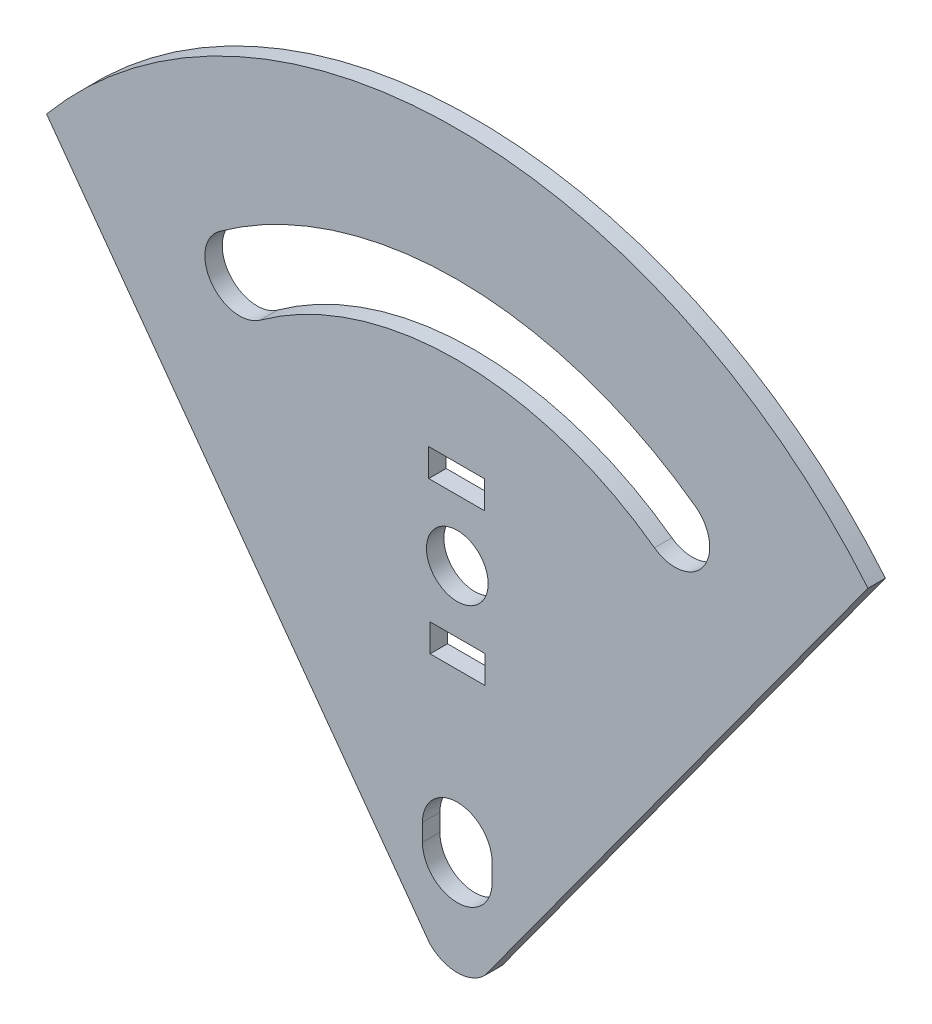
ISO-10303-21;
HEADER;
FILE_DESCRIPTION(('STEP AP214'),'2;1');
FILE_NAME('part.step','',(''),(''),'','','');
FILE_SCHEMA(('AUTOMOTIVE_DESIGN { 1 0 10303 214 1 1 1 1 }'));
ENDSEC;
DATA;
#1=APPLICATION_CONTEXT('core data for automotive mechanical design processes');
#2=APPLICATION_PROTOCOL_DEFINITION('international standard','automotive_design',2000,#1);
#3=PRODUCT_CONTEXT('',#1,'mechanical');
#4=PRODUCT('Part','Part','',(#3));
#5=PRODUCT_RELATED_PRODUCT_CATEGORY('part','',(#4));
#6=PRODUCT_DEFINITION_FORMATION('','',#4);
#7=PRODUCT_DEFINITION_CONTEXT('part definition',#1,'design');
#8=PRODUCT_DEFINITION('design','',#6,#7);
#9=PRODUCT_DEFINITION_SHAPE('','',#8);
#10=(LENGTH_UNIT() NAMED_UNIT(*) SI_UNIT(.MILLI.,.METRE.));
#11=(NAMED_UNIT(*) PLANE_ANGLE_UNIT() SI_UNIT($,.RADIAN.));
#12=(NAMED_UNIT(*) SI_UNIT($,.STERADIAN.) SOLID_ANGLE_UNIT());
#13=UNCERTAINTY_MEASURE_WITH_UNIT(LENGTH_MEASURE(1.E-05),#10,'distance_accuracy_value','');
#14=(GEOMETRIC_REPRESENTATION_CONTEXT(3) GLOBAL_UNCERTAINTY_ASSIGNED_CONTEXT((#13)) GLOBAL_UNIT_ASSIGNED_CONTEXT((#10,
#11,#12)) REPRESENTATION_CONTEXT('',''));
#15=CARTESIAN_POINT('',(0.,0.,0.));
#16=DIRECTION('',(0.,0.,1.));
#17=DIRECTION('',(1.,0.,0.));
#18=AXIS2_PLACEMENT_3D('',#15,#16,#17);
#19=CARTESIAN_POINT('',(-3.08558697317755E-13,32.545263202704,2.54));
#20=DIRECTION('',(0.,0.,-1.));
#21=DIRECTION('',(-1.,0.,0.));
#22=AXIS2_PLACEMENT_3D('',#19,#20,#21);
#23=PLANE('',#22);
#24=CARTESIAN_POINT('',(0.,55.245,2.54));
#25=DIRECTION('',(0.,0.,1.));
#26=DIRECTION('',(1.,0.,0.));
#27=AXIS2_PLACEMENT_3D('',#24,#25,#26);
#28=CIRCLE('',#27,4.5);
#29=CARTESIAN_POINT('',(4.5,55.245,2.54));
#30=VERTEX_POINT('',#29);
#31=EDGE_CURVE('E341',#30,#30,#28,.T.);
#32=ORIENTED_EDGE('',*,*,#31,.F.);
#33=EDGE_LOOP('',(#32));
#34=FACE_BOUND('',#33,.T.);
#35=DIRECTION('',(0.,1.,0.));
#36=VECTOR('',#35,1.);
#37=CARTESIAN_POINT('',(-4.16654211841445,64.2103867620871,2.54));
#38=LINE('',#37,#36);
#39=CARTESIAN_POINT('',(-4.16654211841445,64.2103867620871,2.54));
#40=VERTEX_POINT('',#39);
#41=CARTESIAN_POINT('',(-4.16654211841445,68.2492099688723,2.54));
#42=VERTEX_POINT('',#41);
#43=EDGE_CURVE('E192',#40,#42,#38,.T.);
#44=ORIENTED_EDGE('',*,*,#43,.T.);
#45=DIRECTION('',(-1.,0.,0.));
#46=VECTOR('',#45,1.);
#47=CARTESIAN_POINT('',(3.96145788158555,68.2492099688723,2.54));
#48=LINE('',#47,#46);
#49=CARTESIAN_POINT('',(3.96145788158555,68.2492099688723,2.54));
#50=VERTEX_POINT('',#49);
#51=EDGE_CURVE('E54',#50,#42,#48,.T.);
#52=ORIENTED_EDGE('',*,*,#51,.F.);
#53=DIRECTION('',(0.,1.,0.));
#54=VECTOR('',#53,1.);
#55=CARTESIAN_POINT('',(3.96145788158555,64.2103867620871,2.54));
#56=LINE('',#55,#54);
#57=CARTESIAN_POINT('',(3.96145788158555,64.2103867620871,2.54));
#58=VERTEX_POINT('',#57);
#59=EDGE_CURVE('E198',#58,#50,#56,.T.);
#60=ORIENTED_EDGE('',*,*,#59,.F.);
#61=DIRECTION('',(-1.,0.,0.));
#62=VECTOR('',#61,1.);
#63=CARTESIAN_POINT('',(3.96145788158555,64.2103867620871,2.54));
#64=LINE('',#63,#62);
#65=EDGE_CURVE('E182',#58,#40,#64,.T.);
#66=ORIENTED_EDGE('',*,*,#65,.T.);
#67=EDGE_LOOP('',(#44,#52,#60,#66));
#68=FACE_BOUND('',#67,.T.);
#69=CARTESIAN_POINT('',(31.75,76.0393632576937,2.54));
#70=DIRECTION('',(0.,0.,1.));
#71=DIRECTION('',(1.,0.,0.));
#72=AXIS2_PLACEMENT_3D('',#69,#70,#71);
#73=CIRCLE('',#72,5.08);
#74=CARTESIAN_POINT('',(28.7630122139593,71.9303117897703,2.54));
#75=VERTEX_POINT('',#74);
#76=CARTESIAN_POINT('',(34.7369877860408,80.1484147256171,2.54));
#77=VERTEX_POINT('',#76);
#78=EDGE_CURVE('E214',#75,#77,#73,.T.);
#79=ORIENTED_EDGE('',*,*,#78,.F.);
#80=CARTESIAN_POINT('',(0.,32.3624574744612,2.54));
#81=DIRECTION('',(0.,0.,-1.));
#82=DIRECTION('',(1.,0.,0.));
#83=AXIS2_PLACEMENT_3D('',#80,#81,#82);
#84=CIRCLE('',#83,48.9175425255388);
#85=CARTESIAN_POINT('',(-28.7630122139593,71.9303117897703,2.54));
#86=VERTEX_POINT('',#85);
#87=EDGE_CURVE('E684',#86,#75,#84,.T.);
#88=ORIENTED_EDGE('',*,*,#87,.F.);
#89=CARTESIAN_POINT('',(-31.75,76.0393632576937,2.54));
#90=DIRECTION('',(0.,0.,1.));
#91=DIRECTION('',(1.,0.,0.));
#92=AXIS2_PLACEMENT_3D('',#89,#90,#91);
#93=CIRCLE('',#92,5.08);
#94=CARTESIAN_POINT('',(-34.7369877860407,80.1484147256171,2.54));
#95=VERTEX_POINT('',#94);
#96=EDGE_CURVE('E224',#95,#86,#93,.T.);
#97=ORIENTED_EDGE('',*,*,#96,.F.);
#98=CARTESIAN_POINT('',(0.,32.3624574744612,2.54));
#99=DIRECTION('',(0.,0.,1.));
#100=DIRECTION('',(1.,0.,0.));
#101=AXIS2_PLACEMENT_3D('',#98,#99,#100);
#102=CIRCLE('',#101,59.0775425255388);
#103=EDGE_CURVE('E218',#77,#95,#102,.T.);
#104=ORIENTED_EDGE('',*,*,#103,.F.);
#105=EDGE_LOOP('',(#79,#88,#97,#104));
#106=FACE_BOUND('',#105,.T.);
#107=DIRECTION('',(0.588203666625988,-0.808712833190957,0.));
#108=VECTOR('',#107,1.);
#109=CARTESIAN_POINT('',(0.,0.,2.54));
#110=LINE('',#109,#108);
#111=CARTESIAN_POINT('',(-59.9245165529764,82.3893632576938,2.54));
#112=VERTEX_POINT('',#111);
#113=CARTESIAN_POINT('',(-4.00687885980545,5.50900060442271,2.54));
#114=VERTEX_POINT('',#113);
#115=EDGE_CURVE('E231',#112,#114,#110,.T.);
#116=ORIENTED_EDGE('',*,*,#115,.T.);
#117=CARTESIAN_POINT('',(0.,9.51587946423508,2.54));
#118=DIRECTION('',(0.,0.,-1.));
#119=DIRECTION('',(-1.,0.,0.));
#120=AXIS2_PLACEMENT_3D('',#117,#118,#119);
#121=CIRCLE('',#120,5.66658242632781);
#122=CARTESIAN_POINT('',(4.00687885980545,5.50900060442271,2.54));
#123=VERTEX_POINT('',#122);
#124=EDGE_CURVE('E286',#123,#114,#121,.T.);
#125=ORIENTED_EDGE('',*,*,#124,.F.);
#126=DIRECTION('',(0.588203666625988,0.808712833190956,0.));
#127=VECTOR('',#126,1.);
#128=CARTESIAN_POINT('',(0.,0.,2.54));
#129=LINE('',#128,#127);
#130=CARTESIAN_POINT('',(59.9245165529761,82.3893632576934,2.54));
#131=VERTEX_POINT('',#130);
#132=EDGE_CURVE('E248',#123,#131,#129,.T.);
#133=ORIENTED_EDGE('',*,*,#132,.T.);
#134=CARTESIAN_POINT('',(-3.08558697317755E-13,32.545263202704,2.54));
#135=DIRECTION('',(0.,0.,1.));
#136=DIRECTION('',(-1.,0.,0.));
#137=AXIS2_PLACEMENT_3D('',#134,#135,#136);
#138=CIRCLE('',#137,77.9447367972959);
#139=EDGE_CURVE('E237',#131,#112,#138,.T.);
#140=ORIENTED_EDGE('',*,*,#139,.T.);
#141=EDGE_LOOP('',(#116,#125,#133,#140));
#142=FACE_BOUND('',#141,.T.);
#143=CARTESIAN_POINT('',(0.,20.32,2.54));
#144=DIRECTION('',(0.,0.,1.));
#145=DIRECTION('',(1.,0.,0.));
#146=AXIS2_PLACEMENT_3D('',#143,#144,#145);
#147=CIRCLE('',#146,5.08);
#148=CARTESIAN_POINT('',(5.08,20.32,2.54));
#149=VERTEX_POINT('',#148);
#150=CARTESIAN_POINT('',(-5.08,20.32,2.54));
#151=VERTEX_POINT('',#150);
#152=EDGE_CURVE('E385',#149,#151,#147,.T.);
#153=ORIENTED_EDGE('',*,*,#152,.F.);
#154=DIRECTION('',(0.,1.,0.));
#155=VECTOR('',#154,1.);
#156=CARTESIAN_POINT('',(5.08,20.32,2.54));
#157=LINE('',#156,#155);
#158=CARTESIAN_POINT('',(5.08,17.78,2.54));
#159=VERTEX_POINT('',#158);
#160=EDGE_CURVE('E397',#159,#149,#157,.T.);
#161=ORIENTED_EDGE('',*,*,#160,.F.);
#162=CARTESIAN_POINT('',(0.,17.78,2.54));
#163=DIRECTION('',(0.,0.,1.));
#164=DIRECTION('',(1.,0.,0.));
#165=AXIS2_PLACEMENT_3D('',#162,#163,#164);
#166=CIRCLE('',#165,5.08);
#167=CARTESIAN_POINT('',(-5.08,17.78,2.54));
#168=VERTEX_POINT('',#167);
#169=EDGE_CURVE('E394',#168,#159,#166,.T.);
#170=ORIENTED_EDGE('',*,*,#169,.F.);
#171=DIRECTION('',(0.,-1.,0.));
#172=VECTOR('',#171,1.);
#173=CARTESIAN_POINT('',(-5.08,20.32,2.54));
#174=LINE('',#173,#172);
#175=EDGE_CURVE('E388',#151,#168,#174,.T.);
#176=ORIENTED_EDGE('',*,*,#175,.F.);
#177=EDGE_LOOP('',(#153,#161,#170,#176));
#178=FACE_BOUND('',#177,.T.);
#179=DIRECTION('',(0.,-1.,0.));
#180=VECTOR('',#179,1.);
#181=CARTESIAN_POINT('',(4.04820242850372,46.201729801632,2.54));
#182=LINE('',#181,#180);
#183=CARTESIAN_POINT('',(4.04820242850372,46.201729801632,2.54));
#184=VERTEX_POINT('',#183);
#185=CARTESIAN_POINT('',(4.04820242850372,42.1629065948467,2.54));
#186=VERTEX_POINT('',#185);
#187=EDGE_CURVE('E62',#184,#186,#182,.T.);
#188=ORIENTED_EDGE('',*,*,#187,.T.);
#189=DIRECTION('',(-1.,0.,0.));
#190=VECTOR('',#189,1.);
#191=CARTESIAN_POINT('',(4.04820242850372,42.1629065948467,2.54));
#192=LINE('',#191,#190);
#193=CARTESIAN_POINT('',(-3.96555529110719,42.1629065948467,2.54));
#194=VERTEX_POINT('',#193);
#195=EDGE_CURVE('E299',#186,#194,#192,.T.);
#196=ORIENTED_EDGE('',*,*,#195,.T.);
#197=DIRECTION('',(0.,1.,0.));
#198=VECTOR('',#197,1.);
#199=CARTESIAN_POINT('',(-3.96555529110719,42.1629065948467,2.54));
#200=LINE('',#199,#198);
#201=CARTESIAN_POINT('',(-3.96555529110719,46.201729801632,2.54));
#202=VERTEX_POINT('',#201);
#203=EDGE_CURVE('E295',#194,#202,#200,.T.);
#204=ORIENTED_EDGE('',*,*,#203,.T.);
#205=DIRECTION('',(-1.,0.,0.));
#206=VECTOR('',#205,1.);
#207=CARTESIAN_POINT('',(0.0413235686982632,46.201729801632,2.54));
#208=LINE('',#207,#206);
#209=EDGE_CURVE('E291',#184,#202,#208,.T.);
#210=ORIENTED_EDGE('',*,*,#209,.F.);
#211=EDGE_LOOP('',(#188,#196,#204,#210));
#212=FACE_BOUND('',#211,.T.);
#213=ADVANCED_FACE('F39',(#34,#68,#106,#142,#178,#212),#23,.F.);
#214=CARTESIAN_POINT('',(-3.08558697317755E-13,32.545263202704,0.));
#215=DIRECTION('',(0.,0.,-1.));
#216=DIRECTION('',(-1.,0.,0.));
#217=AXIS2_PLACEMENT_3D('',#214,#215,#216);
#218=PLANE('',#217);
#219=CARTESIAN_POINT('',(0.,55.245,0.));
#220=DIRECTION('',(0.,0.,1.));
#221=DIRECTION('',(1.,0.,0.));
#222=AXIS2_PLACEMENT_3D('',#219,#220,#221);
#223=CIRCLE('',#222,4.5);
#224=CARTESIAN_POINT('',(4.5,55.245,0.));
#225=VERTEX_POINT('',#224);
#226=EDGE_CURVE('E310',#225,#225,#223,.T.);
#227=ORIENTED_EDGE('',*,*,#226,.T.);
#228=EDGE_LOOP('',(#227));
#229=FACE_BOUND('',#228,.T.);
#230=DIRECTION('',(1.,0.,0.));
#231=VECTOR('',#230,1.);
#232=CARTESIAN_POINT('',(-3.08558697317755E-13,68.2492099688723,0.));
#233=LINE('',#232,#231);
#234=CARTESIAN_POINT('',(-4.16654211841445,68.2492099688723,0.));
#235=VERTEX_POINT('',#234);
#236=CARTESIAN_POINT('',(3.96145788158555,68.2492099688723,0.));
#237=VERTEX_POINT('',#236);
#238=EDGE_CURVE('E12',#235,#237,#233,.T.);
#239=ORIENTED_EDGE('',*,*,#238,.F.);
#240=DIRECTION('',(0.,-1.,0.));
#241=VECTOR('',#240,1.);
#242=CARTESIAN_POINT('',(-4.16654211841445,32.545263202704,0.));
#243=LINE('',#242,#241);
#244=CARTESIAN_POINT('',(-4.16654211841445,64.2103867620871,0.));
#245=VERTEX_POINT('',#244);
#246=EDGE_CURVE('E268',#235,#245,#243,.T.);
#247=ORIENTED_EDGE('',*,*,#246,.T.);
#248=DIRECTION('',(1.,0.,0.));
#249=VECTOR('',#248,1.);
#250=CARTESIAN_POINT('',(-3.08558697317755E-13,64.2103867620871,0.));
#251=LINE('',#250,#249);
#252=CARTESIAN_POINT('',(3.96145788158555,64.2103867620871,0.));
#253=VERTEX_POINT('',#252);
#254=EDGE_CURVE('E185',#245,#253,#251,.T.);
#255=ORIENTED_EDGE('',*,*,#254,.T.);
#256=DIRECTION('',(0.,-1.,0.));
#257=VECTOR('',#256,1.);
#258=CARTESIAN_POINT('',(3.96145788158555,32.545263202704,0.));
#259=LINE('',#258,#257);
#260=EDGE_CURVE('E47',#237,#253,#259,.T.);
#261=ORIENTED_EDGE('',*,*,#260,.F.);
#262=EDGE_LOOP('',(#239,#247,#255,#261));
#263=FACE_BOUND('',#262,.T.);
#264=CARTESIAN_POINT('',(0.,9.51587946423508,0.));
#265=DIRECTION('',(0.,0.,-1.));
#266=DIRECTION('',(-1.,0.,0.));
#267=AXIS2_PLACEMENT_3D('',#264,#265,#266);
#268=CIRCLE('',#267,5.66658242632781);
#269=CARTESIAN_POINT('',(-4.00687885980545,5.5090006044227,0.));
#270=VERTEX_POINT('',#269);
#271=CARTESIAN_POINT('',(4.00687885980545,5.50900060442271,0.));
#272=VERTEX_POINT('',#271);
#273=EDGE_CURVE('E220',#270,#272,#268,.F.);
#274=ORIENTED_EDGE('',*,*,#273,.F.);
#275=DIRECTION('',(0.588203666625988,-0.808712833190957,0.));
#276=VECTOR('',#275,1.);
#277=CARTESIAN_POINT('',(0.,0.,0.));
#278=LINE('',#277,#276);
#279=CARTESIAN_POINT('',(-59.9245165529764,82.3893632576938,0.));
#280=VERTEX_POINT('',#279);
#281=EDGE_CURVE('E245',#280,#270,#278,.T.);
#282=ORIENTED_EDGE('',*,*,#281,.F.);
#283=CARTESIAN_POINT('',(-3.08558697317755E-13,32.545263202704,0.));
#284=DIRECTION('',(0.,0.,1.));
#285=DIRECTION('',(-1.,0.,0.));
#286=AXIS2_PLACEMENT_3D('',#283,#284,#285);
#287=CIRCLE('',#286,77.9447367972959);
#288=CARTESIAN_POINT('',(59.9245165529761,82.3893632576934,0.));
#289=VERTEX_POINT('',#288);
#290=EDGE_CURVE('E242',#289,#280,#287,.T.);
#291=ORIENTED_EDGE('',*,*,#290,.F.);
#292=DIRECTION('',(0.588203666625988,0.808712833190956,0.));
#293=VECTOR('',#292,1.);
#294=CARTESIAN_POINT('',(0.,0.,0.));
#295=LINE('',#294,#293);
#296=EDGE_CURVE('E240',#272,#289,#295,.T.);
#297=ORIENTED_EDGE('',*,*,#296,.F.);
#298=EDGE_LOOP('',(#274,#282,#291,#297));
#299=FACE_BOUND('',#298,.T.);
#300=DIRECTION('',(0.,1.,0.));
#301=VECTOR('',#300,1.);
#302=CARTESIAN_POINT('',(5.08,20.32,0.));
#303=LINE('',#302,#301);
#304=CARTESIAN_POINT('',(5.08,17.78,0.));
#305=VERTEX_POINT('',#304);
#306=CARTESIAN_POINT('',(5.08,20.32,0.));
#307=VERTEX_POINT('',#306);
#308=EDGE_CURVE('E389',#305,#307,#303,.T.);
#309=ORIENTED_EDGE('',*,*,#308,.T.);
#310=CARTESIAN_POINT('',(0.,20.32,0.));
#311=DIRECTION('',(0.,0.,1.));
#312=DIRECTION('',(1.,0.,0.));
#313=AXIS2_PLACEMENT_3D('',#310,#311,#312);
#314=CIRCLE('',#313,5.08);
#315=CARTESIAN_POINT('',(-5.08,20.32,0.));
#316=VERTEX_POINT('',#315);
#317=EDGE_CURVE('E401',#307,#316,#314,.T.);
#318=ORIENTED_EDGE('',*,*,#317,.T.);
#319=DIRECTION('',(0.,-1.,0.));
#320=VECTOR('',#319,1.);
#321=CARTESIAN_POINT('',(-5.08,20.32,0.));
#322=LINE('',#321,#320);
#323=CARTESIAN_POINT('',(-5.08,17.78,0.));
#324=VERTEX_POINT('',#323);
#325=EDGE_CURVE('E404',#316,#324,#322,.T.);
#326=ORIENTED_EDGE('',*,*,#325,.T.);
#327=CARTESIAN_POINT('',(0.,17.78,0.));
#328=DIRECTION('',(0.,0.,1.));
#329=DIRECTION('',(1.,0.,0.));
#330=AXIS2_PLACEMENT_3D('',#327,#328,#329);
#331=CIRCLE('',#330,5.08);
#332=EDGE_CURVE('E407',#324,#305,#331,.T.);
#333=ORIENTED_EDGE('',*,*,#332,.T.);
#334=EDGE_LOOP('',(#309,#318,#326,#333));
#335=FACE_BOUND('',#334,.T.);
#336=CARTESIAN_POINT('',(0.,32.3624574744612,0.));
#337=DIRECTION('',(0.,0.,-1.));
#338=DIRECTION('',(1.,0.,0.));
#339=AXIS2_PLACEMENT_3D('',#336,#337,#338);
#340=CIRCLE('',#339,48.9175425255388);
#341=CARTESIAN_POINT('',(-28.7630122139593,71.9303117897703,0.));
#342=VERTEX_POINT('',#341);
#343=CARTESIAN_POINT('',(28.7630122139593,71.9303117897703,0.));
#344=VERTEX_POINT('',#343);
#345=EDGE_CURVE('E219',#342,#344,#340,.T.);
#346=ORIENTED_EDGE('',*,*,#345,.T.);
#347=CARTESIAN_POINT('',(31.75,76.0393632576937,0.));
#348=DIRECTION('',(0.,0.,1.));
#349=DIRECTION('',(1.,0.,0.));
#350=AXIS2_PLACEMENT_3D('',#347,#348,#349);
#351=CIRCLE('',#350,5.08);
#352=CARTESIAN_POINT('',(34.7369877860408,80.1484147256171,0.));
#353=VERTEX_POINT('',#352);
#354=EDGE_CURVE('E332',#344,#353,#351,.T.);
#355=ORIENTED_EDGE('',*,*,#354,.T.);
#356=CARTESIAN_POINT('',(0.,32.3624574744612,0.));
#357=DIRECTION('',(0.,0.,1.));
#358=DIRECTION('',(1.,0.,0.));
#359=AXIS2_PLACEMENT_3D('',#356,#357,#358);
#360=CIRCLE('',#359,59.0775425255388);
#361=CARTESIAN_POINT('',(-34.7369877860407,80.1484147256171,0.));
#362=VERTEX_POINT('',#361);
#363=EDGE_CURVE('E334',#353,#362,#360,.T.);
#364=ORIENTED_EDGE('',*,*,#363,.T.);
#365=CARTESIAN_POINT('',(-31.75,76.0393632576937,0.));
#366=DIRECTION('',(0.,0.,1.));
#367=DIRECTION('',(1.,0.,0.));
#368=AXIS2_PLACEMENT_3D('',#365,#366,#367);
#369=CIRCLE('',#368,5.08);
#370=EDGE_CURVE('E675',#362,#342,#369,.T.);
#371=ORIENTED_EDGE('',*,*,#370,.T.);
#372=EDGE_LOOP('',(#346,#355,#364,#371));
#373=FACE_BOUND('',#372,.T.);
#374=DIRECTION('',(1.,0.,0.));
#375=VECTOR('',#374,1.);
#376=CARTESIAN_POINT('',(-3.08558697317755E-13,42.1629065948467,0.));
#377=LINE('',#376,#375);
#378=CARTESIAN_POINT('',(-3.96555529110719,42.1629065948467,0.));
#379=VERTEX_POINT('',#378);
#380=CARTESIAN_POINT('',(4.04820242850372,42.1629065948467,0.));
#381=VERTEX_POINT('',#380);
#382=EDGE_CURVE('E262',#379,#381,#377,.T.);
#383=ORIENTED_EDGE('',*,*,#382,.T.);
#384=DIRECTION('',(0.,1.,0.));
#385=VECTOR('',#384,1.);
#386=CARTESIAN_POINT('',(4.04820242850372,32.545263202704,0.));
#387=LINE('',#386,#385);
#388=CARTESIAN_POINT('',(4.04820242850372,46.201729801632,0.));
#389=VERTEX_POINT('',#388);
#390=EDGE_CURVE('E265',#381,#389,#387,.T.);
#391=ORIENTED_EDGE('',*,*,#390,.T.);
#392=DIRECTION('',(1.,0.,0.));
#393=VECTOR('',#392,1.);
#394=CARTESIAN_POINT('',(-3.08558697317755E-13,46.201729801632,0.));
#395=LINE('',#394,#393);
#396=CARTESIAN_POINT('',(-3.96555529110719,46.201729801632,0.));
#397=VERTEX_POINT('',#396);
#398=EDGE_CURVE('E257',#397,#389,#395,.T.);
#399=ORIENTED_EDGE('',*,*,#398,.F.);
#400=DIRECTION('',(0.,-1.,0.));
#401=VECTOR('',#400,1.);
#402=CARTESIAN_POINT('',(-3.96555529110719,32.545263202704,0.));
#403=LINE('',#402,#401);
#404=EDGE_CURVE('E259',#397,#379,#403,.T.);
#405=ORIENTED_EDGE('',*,*,#404,.T.);
#406=EDGE_LOOP('',(#383,#391,#399,#405));
#407=FACE_BOUND('',#406,.T.);
#408=ADVANCED_FACE('F278',(#229,#263,#299,#335,#373,#407),#218,.T.);
#409=CARTESIAN_POINT('',(0.,0.,2.54));
#410=DIRECTION('',(-0.808712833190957,0.588203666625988,0.));
#411=DIRECTION('',(-0.588203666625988,-0.808712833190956,0.));
#412=AXIS2_PLACEMENT_3D('',#409,#410,#411);
#413=PLANE('',#412);
#414=ORIENTED_EDGE('',*,*,#132,.F.);
#415=DIRECTION('',(0.,0.,1.));
#416=VECTOR('',#415,1.);
#417=CARTESIAN_POINT('',(4.00687885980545,5.50900060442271,-8.636));
#418=LINE('',#417,#416);
#419=EDGE_CURVE('E309',#272,#123,#418,.T.);
#420=ORIENTED_EDGE('',*,*,#419,.F.);
#421=ORIENTED_EDGE('',*,*,#296,.T.);
#422=DIRECTION('',(0.,0.,-1.));
#423=VECTOR('',#422,1.);
#424=CARTESIAN_POINT('',(59.9245165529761,82.3893632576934,2.54));
#425=LINE('',#424,#423);
#426=EDGE_CURVE('E251',#131,#289,#425,.T.);
#427=ORIENTED_EDGE('',*,*,#426,.F.);
#428=EDGE_LOOP('',(#414,#420,#421,#427));
#429=FACE_BOUND('',#428,.T.);
#430=ADVANCED_FACE('F41',(#429),#413,.F.);
#431=CARTESIAN_POINT('',(-3.08558697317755E-13,32.545263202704,2.54));
#432=DIRECTION('',(0.,0.,-1.));
#433=DIRECTION('',(-1.,0.,0.));
#434=AXIS2_PLACEMENT_3D('',#431,#432,#433);
#435=CYLINDRICAL_SURFACE('',#434,77.9447367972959);
#436=ORIENTED_EDGE('',*,*,#290,.T.);
#437=DIRECTION('',(0.,0.,-1.));
#438=VECTOR('',#437,1.);
#439=CARTESIAN_POINT('',(-59.9245165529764,82.3893632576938,2.54));
#440=LINE('',#439,#438);
#441=EDGE_CURVE('E236',#112,#280,#440,.T.);
#442=ORIENTED_EDGE('',*,*,#441,.F.);
#443=ORIENTED_EDGE('',*,*,#139,.F.);
#444=ORIENTED_EDGE('',*,*,#426,.T.);
#445=EDGE_LOOP('',(#436,#442,#443,#444));
#446=FACE_BOUND('',#445,.T.);
#447=ADVANCED_FACE('F328',(#446),#435,.T.);
#448=CARTESIAN_POINT('',(0.,0.,2.54));
#449=DIRECTION('',(0.808712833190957,0.588203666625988,0.));
#450=DIRECTION('',(-0.588203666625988,0.808712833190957,0.));
#451=AXIS2_PLACEMENT_3D('',#448,#449,#450);
#452=PLANE('',#451);
#453=ORIENTED_EDGE('',*,*,#281,.T.);
#454=DIRECTION('',(0.,0.,1.));
#455=VECTOR('',#454,1.);
#456=CARTESIAN_POINT('',(-4.00687885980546,5.50900060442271,-8.636));
#457=LINE('',#456,#455);
#458=EDGE_CURVE('E254',#270,#114,#457,.T.);
#459=ORIENTED_EDGE('',*,*,#458,.T.);
#460=ORIENTED_EDGE('',*,*,#115,.F.);
#461=ORIENTED_EDGE('',*,*,#441,.T.);
#462=EDGE_LOOP('',(#453,#459,#460,#461));
#463=FACE_BOUND('',#462,.T.);
#464=ADVANCED_FACE('F321',(#463),#452,.F.);
#465=CARTESIAN_POINT('',(0.,20.32,2.54));
#466=DIRECTION('',(0.,0.,-1.));
#467=DIRECTION('',(-1.,0.,0.));
#468=AXIS2_PLACEMENT_3D('',#465,#466,#467);
#469=CYLINDRICAL_SURFACE('',#468,5.08);
#470=ORIENTED_EDGE('',*,*,#317,.F.);
#471=DIRECTION('',(0.,0.,-1.));
#472=VECTOR('',#471,1.);
#473=CARTESIAN_POINT('',(5.08,20.32,2.54));
#474=LINE('',#473,#472);
#475=EDGE_CURVE('E400',#149,#307,#474,.T.);
#476=ORIENTED_EDGE('',*,*,#475,.F.);
#477=ORIENTED_EDGE('',*,*,#152,.T.);
#478=DIRECTION('',(0.,0.,-1.));
#479=VECTOR('',#478,1.);
#480=CARTESIAN_POINT('',(-5.08,20.32,2.54));
#481=LINE('',#480,#479);
#482=EDGE_CURVE('E243',#151,#316,#481,.T.);
#483=ORIENTED_EDGE('',*,*,#482,.T.);
#484=EDGE_LOOP('',(#470,#476,#477,#483));
#485=FACE_BOUND('',#484,.T.);
#486=ADVANCED_FACE('F366',(#485),#469,.F.);
#487=CARTESIAN_POINT('',(-5.08,20.32,2.54));
#488=DIRECTION('',(1.,0.,0.));
#489=DIRECTION('',(0.,0.,-1.));
#490=AXIS2_PLACEMENT_3D('',#487,#488,#489);
#491=PLANE('',#490);
#492=ORIENTED_EDGE('',*,*,#325,.F.);
#493=ORIENTED_EDGE('',*,*,#482,.F.);
#494=ORIENTED_EDGE('',*,*,#175,.T.);
#495=DIRECTION('',(0.,0.,-1.));
#496=VECTOR('',#495,1.);
#497=CARTESIAN_POINT('',(-5.08,17.78,2.54));
#498=LINE('',#497,#496);
#499=EDGE_CURVE('E415',#168,#324,#498,.T.);
#500=ORIENTED_EDGE('',*,*,#499,.T.);
#501=EDGE_LOOP('',(#492,#493,#494,#500));
#502=FACE_BOUND('',#501,.T.);
#503=ADVANCED_FACE('F432',(#502),#491,.T.);
#504=CARTESIAN_POINT('',(0.,17.78,2.54));
#505=DIRECTION('',(0.,0.,-1.));
#506=DIRECTION('',(-1.,0.,0.));
#507=AXIS2_PLACEMENT_3D('',#504,#505,#506);
#508=CYLINDRICAL_SURFACE('',#507,5.08);
#509=ORIENTED_EDGE('',*,*,#332,.F.);
#510=ORIENTED_EDGE('',*,*,#499,.F.);
#511=ORIENTED_EDGE('',*,*,#169,.T.);
#512=DIRECTION('',(0.,0.,-1.));
#513=VECTOR('',#512,1.);
#514=CARTESIAN_POINT('',(5.08,17.78,2.54));
#515=LINE('',#514,#513);
#516=EDGE_CURVE('E414',#159,#305,#515,.T.);
#517=ORIENTED_EDGE('',*,*,#516,.T.);
#518=EDGE_LOOP('',(#509,#510,#511,#517));
#519=FACE_BOUND('',#518,.T.);
#520=ADVANCED_FACE('F434',(#519),#508,.F.);
#521=CARTESIAN_POINT('',(5.08,20.32,2.54));
#522=DIRECTION('',(-1.,0.,0.));
#523=DIRECTION('',(0.,0.,1.));
#524=AXIS2_PLACEMENT_3D('',#521,#522,#523);
#525=PLANE('',#524);
#526=ORIENTED_EDGE('',*,*,#308,.F.);
#527=ORIENTED_EDGE('',*,*,#516,.F.);
#528=ORIENTED_EDGE('',*,*,#160,.T.);
#529=ORIENTED_EDGE('',*,*,#475,.T.);
#530=EDGE_LOOP('',(#526,#527,#528,#529));
#531=FACE_BOUND('',#530,.T.);
#532=ADVANCED_FACE('F428',(#531),#525,.T.);
#533=CARTESIAN_POINT('',(31.75,76.0393632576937,2.54));
#534=DIRECTION('',(0.,0.,-1.));
#535=DIRECTION('',(-1.,0.,0.));
#536=AXIS2_PLACEMENT_3D('',#533,#534,#535);
#537=CYLINDRICAL_SURFACE('',#536,5.08);
#538=ORIENTED_EDGE('',*,*,#354,.F.);
#539=DIRECTION('',(0.,0.,-1.));
#540=VECTOR('',#539,1.);
#541=CARTESIAN_POINT('',(28.7630122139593,71.9303117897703,2.54));
#542=LINE('',#541,#540);
#543=EDGE_CURVE('E674',#75,#344,#542,.T.);
#544=ORIENTED_EDGE('',*,*,#543,.F.);
#545=ORIENTED_EDGE('',*,*,#78,.T.);
#546=DIRECTION('',(0.,0.,-1.));
#547=VECTOR('',#546,1.);
#548=CARTESIAN_POINT('',(34.7369877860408,80.1484147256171,2.54));
#549=LINE('',#548,#547);
#550=EDGE_CURVE('E390',#77,#353,#549,.T.);
#551=ORIENTED_EDGE('',*,*,#550,.T.);
#552=EDGE_LOOP('',(#538,#544,#545,#551));
#553=FACE_BOUND('',#552,.T.);
#554=ADVANCED_FACE('F441',(#553),#537,.F.);
#555=CARTESIAN_POINT('',(0.,32.3624574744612,2.54));
#556=DIRECTION('',(0.,0.,-1.));
#557=DIRECTION('',(-1.,0.,0.));
#558=AXIS2_PLACEMENT_3D('',#555,#556,#557);
#559=CYLINDRICAL_SURFACE('',#558,59.0775425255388);
#560=ORIENTED_EDGE('',*,*,#363,.F.);
#561=ORIENTED_EDGE('',*,*,#550,.F.);
#562=ORIENTED_EDGE('',*,*,#103,.T.);
#563=DIRECTION('',(0.,0.,-1.));
#564=VECTOR('',#563,1.);
#565=CARTESIAN_POINT('',(-34.7369877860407,80.1484147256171,2.54));
#566=LINE('',#565,#564);
#567=EDGE_CURVE('E685',#95,#362,#566,.T.);
#568=ORIENTED_EDGE('',*,*,#567,.T.);
#569=EDGE_LOOP('',(#560,#561,#562,#568));
#570=FACE_BOUND('',#569,.T.);
#571=ADVANCED_FACE('F446',(#570),#559,.F.);
#572=CARTESIAN_POINT('',(-31.75,76.0393632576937,2.54));
#573=DIRECTION('',(0.,0.,-1.));
#574=DIRECTION('',(-1.,0.,0.));
#575=AXIS2_PLACEMENT_3D('',#572,#573,#574);
#576=CYLINDRICAL_SURFACE('',#575,5.08);
#577=ORIENTED_EDGE('',*,*,#370,.F.);
#578=ORIENTED_EDGE('',*,*,#567,.F.);
#579=ORIENTED_EDGE('',*,*,#96,.T.);
#580=DIRECTION('',(0.,0.,-1.));
#581=VECTOR('',#580,1.);
#582=CARTESIAN_POINT('',(-28.7630122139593,71.9303117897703,2.54));
#583=LINE('',#582,#581);
#584=EDGE_CURVE('E671',#86,#342,#583,.T.);
#585=ORIENTED_EDGE('',*,*,#584,.T.);
#586=EDGE_LOOP('',(#577,#578,#579,#585));
#587=FACE_BOUND('',#586,.T.);
#588=ADVANCED_FACE('F450',(#587),#576,.F.);
#589=CARTESIAN_POINT('',(0.,32.3624574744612,2.54));
#590=DIRECTION('',(0.,0.,-1.));
#591=DIRECTION('',(-1.,0.,0.));
#592=AXIS2_PLACEMENT_3D('',#589,#590,#591);
#593=CYLINDRICAL_SURFACE('',#592,48.9175425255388);
#594=ORIENTED_EDGE('',*,*,#345,.F.);
#595=ORIENTED_EDGE('',*,*,#584,.F.);
#596=ORIENTED_EDGE('',*,*,#87,.T.);
#597=ORIENTED_EDGE('',*,*,#543,.T.);
#598=EDGE_LOOP('',(#594,#595,#596,#597));
#599=FACE_BOUND('',#598,.T.);
#600=ADVANCED_FACE('F454',(#599),#593,.T.);
#601=CARTESIAN_POINT('',(0.,9.51587946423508,-8.636));
#602=DIRECTION('',(0.,0.,1.));
#603=DIRECTION('',(1.,0.,0.));
#604=AXIS2_PLACEMENT_3D('',#601,#602,#603);
#605=CYLINDRICAL_SURFACE('',#604,5.66658242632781);
#606=ORIENTED_EDGE('',*,*,#273,.T.);
#607=ORIENTED_EDGE('',*,*,#419,.T.);
#608=ORIENTED_EDGE('',*,*,#124,.T.);
#609=ORIENTED_EDGE('',*,*,#458,.F.);
#610=EDGE_LOOP('',(#606,#607,#608,#609));
#611=FACE_BOUND('',#610,.T.);
#612=ADVANCED_FACE('F314',(#611),#605,.T.);
#613=CARTESIAN_POINT('',(4.04820242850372,46.201729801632,-8.636));
#614=DIRECTION('',(-1.,0.,0.));
#615=DIRECTION('',(0.,0.,1.));
#616=AXIS2_PLACEMENT_3D('',#613,#614,#615);
#617=PLANE('',#616);
#618=DIRECTION('',(0.,0.,1.));
#619=VECTOR('',#618,1.);
#620=CARTESIAN_POINT('',(4.04820242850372,42.1629065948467,-8.636));
#621=LINE('',#620,#619);
#622=EDGE_CURVE('E285',#381,#186,#621,.T.);
#623=ORIENTED_EDGE('',*,*,#622,.T.);
#624=ORIENTED_EDGE('',*,*,#187,.F.);
#625=DIRECTION('',(0.,0.,1.));
#626=VECTOR('',#625,1.);
#627=CARTESIAN_POINT('',(4.04820242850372,46.201729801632,-8.636));
#628=LINE('',#627,#626);
#629=EDGE_CURVE('E283',#389,#184,#628,.T.);
#630=ORIENTED_EDGE('',*,*,#629,.F.);
#631=ORIENTED_EDGE('',*,*,#390,.F.);
#632=EDGE_LOOP('',(#623,#624,#630,#631));
#633=FACE_BOUND('',#632,.T.);
#634=ADVANCED_FACE('F461',(#633),#617,.T.);
#635=CARTESIAN_POINT('',(4.04820242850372,42.1629065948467,-8.636));
#636=DIRECTION('',(0.,1.,0.));
#637=DIRECTION('',(0.,0.,1.));
#638=AXIS2_PLACEMENT_3D('',#635,#636,#637);
#639=PLANE('',#638);
#640=DIRECTION('',(0.,0.,1.));
#641=VECTOR('',#640,1.);
#642=CARTESIAN_POINT('',(-3.96555529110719,42.1629065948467,-8.636));
#643=LINE('',#642,#641);
#644=EDGE_CURVE('E288',#379,#194,#643,.T.);
#645=ORIENTED_EDGE('',*,*,#644,.T.);
#646=ORIENTED_EDGE('',*,*,#195,.F.);
#647=ORIENTED_EDGE('',*,*,#622,.F.);
#648=ORIENTED_EDGE('',*,*,#382,.F.);
#649=EDGE_LOOP('',(#645,#646,#647,#648));
#650=FACE_BOUND('',#649,.T.);
#651=ADVANCED_FACE('F469',(#650),#639,.T.);
#652=CARTESIAN_POINT('',(-3.96555529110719,42.1629065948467,-8.636));
#653=DIRECTION('',(1.,0.,0.));
#654=DIRECTION('',(0.,0.,-1.));
#655=AXIS2_PLACEMENT_3D('',#652,#653,#654);
#656=PLANE('',#655);
#657=DIRECTION('',(0.,0.,1.));
#658=VECTOR('',#657,1.);
#659=CARTESIAN_POINT('',(-3.96555529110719,46.201729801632,-8.636));
#660=LINE('',#659,#658);
#661=EDGE_CURVE('E290',#397,#202,#660,.T.);
#662=ORIENTED_EDGE('',*,*,#661,.T.);
#663=ORIENTED_EDGE('',*,*,#203,.F.);
#664=ORIENTED_EDGE('',*,*,#644,.F.);
#665=ORIENTED_EDGE('',*,*,#404,.F.);
#666=EDGE_LOOP('',(#662,#663,#664,#665));
#667=FACE_BOUND('',#666,.T.);
#668=ADVANCED_FACE('F465',(#667),#656,.T.);
#669=CARTESIAN_POINT('',(0.0413235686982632,46.201729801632,-8.636));
#670=DIRECTION('',(0.,1.,0.));
#671=DIRECTION('',(0.,0.,1.));
#672=AXIS2_PLACEMENT_3D('',#669,#670,#671);
#673=PLANE('',#672);
#674=ORIENTED_EDGE('',*,*,#398,.T.);
#675=ORIENTED_EDGE('',*,*,#629,.T.);
#676=ORIENTED_EDGE('',*,*,#209,.T.);
#677=ORIENTED_EDGE('',*,*,#661,.F.);
#678=EDGE_LOOP('',(#674,#675,#676,#677));
#679=FACE_BOUND('',#678,.T.);
#680=ADVANCED_FACE('F462',(#679),#673,.F.);
#681=CARTESIAN_POINT('',(3.96145788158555,68.2492099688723,-8.636));
#682=DIRECTION('',(0.,1.,0.));
#683=DIRECTION('',(0.,0.,1.));
#684=AXIS2_PLACEMENT_3D('',#681,#682,#683);
#685=PLANE('',#684);
#686=ORIENTED_EDGE('',*,*,#238,.T.);
#687=DIRECTION('',(0.,0.,1.));
#688=VECTOR('',#687,1.);
#689=CARTESIAN_POINT('',(3.96145788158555,68.2492099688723,-8.636));
#690=LINE('',#689,#688);
#691=EDGE_CURVE('E274',#237,#50,#690,.T.);
#692=ORIENTED_EDGE('',*,*,#691,.T.);
#693=ORIENTED_EDGE('',*,*,#51,.T.);
#694=DIRECTION('',(0.,0.,1.));
#695=VECTOR('',#694,1.);
#696=CARTESIAN_POINT('',(-4.16654211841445,68.2492099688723,-8.636));
#697=LINE('',#696,#695);
#698=EDGE_CURVE('E189',#235,#42,#697,.T.);
#699=ORIENTED_EDGE('',*,*,#698,.F.);
#700=EDGE_LOOP('',(#686,#692,#693,#699));
#701=FACE_BOUND('',#700,.T.);
#702=ADVANCED_FACE('F280',(#701),#685,.F.);
#703=CARTESIAN_POINT('',(3.96145788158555,64.2103867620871,-8.636));
#704=DIRECTION('',(1.,0.,0.));
#705=DIRECTION('',(0.,0.,-1.));
#706=AXIS2_PLACEMENT_3D('',#703,#704,#705);
#707=PLANE('',#706);
#708=ORIENTED_EDGE('',*,*,#260,.T.);
#709=DIRECTION('',(0.,0.,1.));
#710=VECTOR('',#709,1.);
#711=CARTESIAN_POINT('',(3.96145788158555,64.2103867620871,-8.636));
#712=LINE('',#711,#710);
#713=EDGE_CURVE('E188',#253,#58,#712,.T.);
#714=ORIENTED_EDGE('',*,*,#713,.T.);
#715=ORIENTED_EDGE('',*,*,#59,.T.);
#716=ORIENTED_EDGE('',*,*,#691,.F.);
#717=EDGE_LOOP('',(#708,#714,#715,#716));
#718=FACE_BOUND('',#717,.T.);
#719=ADVANCED_FACE('F273',(#718),#707,.F.);
#720=CARTESIAN_POINT('',(3.96145788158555,64.2103867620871,-8.636));
#721=DIRECTION('',(0.,1.,0.));
#722=DIRECTION('',(0.,0.,1.));
#723=AXIS2_PLACEMENT_3D('',#720,#721,#722);
#724=PLANE('',#723);
#725=DIRECTION('',(0.,0.,1.));
#726=VECTOR('',#725,1.);
#727=CARTESIAN_POINT('',(-4.16654211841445,64.2103867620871,-8.636));
#728=LINE('',#727,#726);
#729=EDGE_CURVE('E177',#245,#40,#728,.T.);
#730=ORIENTED_EDGE('',*,*,#729,.T.);
#731=ORIENTED_EDGE('',*,*,#65,.F.);
#732=ORIENTED_EDGE('',*,*,#713,.F.);
#733=ORIENTED_EDGE('',*,*,#254,.F.);
#734=EDGE_LOOP('',(#730,#731,#732,#733));
#735=FACE_BOUND('',#734,.T.);
#736=ADVANCED_FACE('F179',(#735),#724,.T.);
#737=CARTESIAN_POINT('',(-4.16654211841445,64.2103867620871,-8.636));
#738=DIRECTION('',(1.,0.,0.));
#739=DIRECTION('',(0.,0.,-1.));
#740=AXIS2_PLACEMENT_3D('',#737,#738,#739);
#741=PLANE('',#740);
#742=ORIENTED_EDGE('',*,*,#698,.T.);
#743=ORIENTED_EDGE('',*,*,#43,.F.);
#744=ORIENTED_EDGE('',*,*,#729,.F.);
#745=ORIENTED_EDGE('',*,*,#246,.F.);
#746=EDGE_LOOP('',(#742,#743,#744,#745));
#747=FACE_BOUND('',#746,.T.);
#748=ADVANCED_FACE('F193',(#747),#741,.T.);
#749=CARTESIAN_POINT('',(0.,55.245,2.54));
#750=DIRECTION('',(0.,0.,1.));
#751=DIRECTION('',(1.,0.,0.));
#752=AXIS2_PLACEMENT_3D('',#749,#750,#751);
#753=CYLINDRICAL_SURFACE('',#752,4.5);
#754=ORIENTED_EDGE('',*,*,#226,.F.);
#755=EDGE_LOOP('',(#754));
#756=FACE_BOUND('',#755,.T.);
#757=ORIENTED_EDGE('',*,*,#31,.T.);
#758=EDGE_LOOP('',(#757));
#759=FACE_BOUND('',#758,.T.);
#760=ADVANCED_FACE('F350',(#756,#759),#753,.F.);
#761=CLOSED_SHELL('',(#213,#408,#430,#447,#464,#486,#503,#520,#532,#554,#571,#588,#600,#612,
#634,#651,#668,#680,#702,#719,#736,#748,#760));
#762=MANIFOLD_SOLID_BREP('B2',#761);
#763=ADVANCED_BREP_SHAPE_REPRESENTATION('',(#18,#762),#14);
#764=SHAPE_DEFINITION_REPRESENTATION(#9,#763);
ENDSEC;
END-ISO-10303-21;
